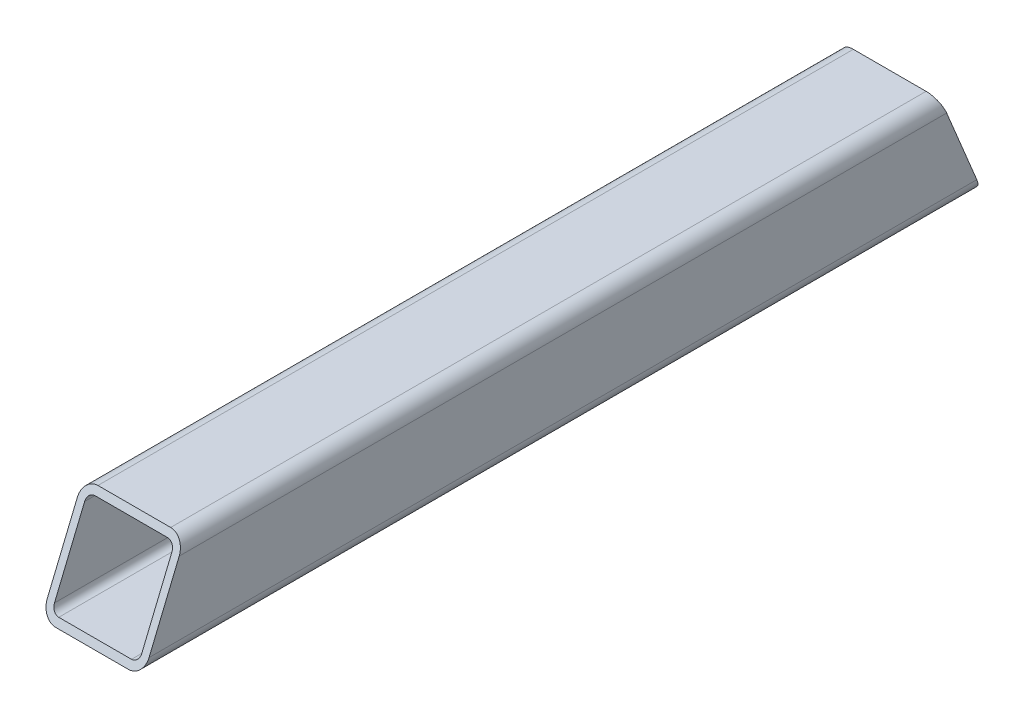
ISO-10303-21;
HEADER;
FILE_DESCRIPTION(('STEP AP214'),'2;1');
FILE_NAME('part.step','',(''),(''),'','','');
FILE_SCHEMA(('AUTOMOTIVE_DESIGN { 1 0 10303 214 1 1 1 1 }'));
ENDSEC;
DATA;
#1=APPLICATION_CONTEXT('core data for automotive mechanical design processes');
#2=APPLICATION_PROTOCOL_DEFINITION('international standard','automotive_design',2000,#1);
#3=PRODUCT_CONTEXT('',#1,'mechanical');
#4=PRODUCT('Part','Part','',(#3));
#5=PRODUCT_RELATED_PRODUCT_CATEGORY('part','',(#4));
#6=PRODUCT_DEFINITION_FORMATION('','',#4);
#7=PRODUCT_DEFINITION_CONTEXT('part definition',#1,'design');
#8=PRODUCT_DEFINITION('design','',#6,#7);
#9=PRODUCT_DEFINITION_SHAPE('','',#8);
#10=(LENGTH_UNIT() NAMED_UNIT(*) SI_UNIT(.MILLI.,.METRE.));
#11=(NAMED_UNIT(*) PLANE_ANGLE_UNIT() SI_UNIT($,.RADIAN.));
#12=(NAMED_UNIT(*) SI_UNIT($,.STERADIAN.) SOLID_ANGLE_UNIT());
#13=UNCERTAINTY_MEASURE_WITH_UNIT(LENGTH_MEASURE(1.E-05),#10,'distance_accuracy_value','');
#14=(GEOMETRIC_REPRESENTATION_CONTEXT(3) GLOBAL_UNCERTAINTY_ASSIGNED_CONTEXT((#13)) GLOBAL_UNIT_ASSIGNED_CONTEXT((#10,
#11,#12)) REPRESENTATION_CONTEXT('',''));
#15=CARTESIAN_POINT('',(0.,0.,0.));
#16=DIRECTION('',(0.,0.,1.));
#17=DIRECTION('',(1.,0.,0.));
#18=AXIS2_PLACEMENT_3D('',#15,#16,#17);
#19=CARTESIAN_POINT('',(-25.,-25.,297.));
#20=DIRECTION('',(0.,0.,-1.));
#21=DIRECTION('',(-1.,0.,0.));
#22=AXIS2_PLACEMENT_3D('',#19,#20,#21);
#23=CYLINDRICAL_SURFACE('',#22,10.);
#24=DIRECTION('',(0.,0.,-1.));
#25=VECTOR('',#24,1.);
#26=CARTESIAN_POINT('',(-25.,-35.,297.));
#27=LINE('',#26,#25);
#28=CARTESIAN_POINT('',(-25.,-35.,288.549214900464));
#29=VERTEX_POINT('',#28);
#30=CARTESIAN_POINT('',(-25.,-35.,-288.549214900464));
#31=VERTEX_POINT('',#30);
#32=EDGE_CURVE('E264',#29,#31,#27,.T.);
#33=ORIENTED_EDGE('',*,*,#32,.F.);
#34=CARTESIAN_POINT('',(-25.,-25.,284.407079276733));
#35=DIRECTION('',(0.,-0.382683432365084,-0.923879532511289));
#36=DIRECTION('',(0.,0.923879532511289,-0.382683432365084));
#37=AXIS2_PLACEMENT_3D('',#34,#35,#36);
#38=ELLIPSE('',#37,10.8239220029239,10.);
#39=CARTESIAN_POINT('',(-35.,-25.,284.407079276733));
#40=VERTEX_POINT('',#39);
#41=EDGE_CURVE('E191',#29,#40,#38,.T.);
#42=ORIENTED_EDGE('',*,*,#41,.T.);
#43=DIRECTION('',(0.,0.,-1.));
#44=VECTOR('',#43,1.);
#45=CARTESIAN_POINT('',(-35.,-25.,297.));
#46=LINE('',#45,#44);
#47=CARTESIAN_POINT('',(-35.,-25.,-284.407079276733));
#48=VERTEX_POINT('',#47);
#49=EDGE_CURVE('E250',#40,#48,#46,.T.);
#50=ORIENTED_EDGE('',*,*,#49,.T.);
#51=CARTESIAN_POINT('',(-25.,-25.,-284.407079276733));
#52=DIRECTION('',(0.,0.382683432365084,-0.923879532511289));
#53=DIRECTION('',(0.,-0.923879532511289,-0.382683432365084));
#54=AXIS2_PLACEMENT_3D('',#51,#52,#53);
#55=ELLIPSE('',#54,10.8239220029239,10.);
#56=EDGE_CURVE('E235',#31,#48,#55,.T.);
#57=ORIENTED_EDGE('',*,*,#56,.F.);
#58=EDGE_LOOP('',(#33,#42,#50,#57));
#59=FACE_BOUND('',#58,.T.);
#60=ADVANCED_FACE('F34',(#59),#23,.T.);
#61=CARTESIAN_POINT('',(-25.,-35.,297.));
#62=DIRECTION('',(0.,1.,0.));
#63=DIRECTION('',(0.,0.,1.));
#64=AXIS2_PLACEMENT_3D('',#61,#62,#63);
#65=PLANE('',#64);
#66=DIRECTION('',(0.,0.,-1.));
#67=VECTOR('',#66,1.);
#68=CARTESIAN_POINT('',(25.,-35.,297.));
#69=LINE('',#68,#67);
#70=CARTESIAN_POINT('',(25.,-35.,288.549214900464));
#71=VERTEX_POINT('',#70);
#72=CARTESIAN_POINT('',(25.,-35.,-288.549214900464));
#73=VERTEX_POINT('',#72);
#74=EDGE_CURVE('E262',#71,#73,#69,.T.);
#75=ORIENTED_EDGE('',*,*,#74,.F.);
#76=DIRECTION('',(-1.,0.,0.));
#77=VECTOR('',#76,1.);
#78=CARTESIAN_POINT('',(-25.,-35.,288.549214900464));
#79=LINE('',#78,#77);
#80=EDGE_CURVE('E188',#71,#29,#79,.T.);
#81=ORIENTED_EDGE('',*,*,#80,.T.);
#82=ORIENTED_EDGE('',*,*,#32,.T.);
#83=DIRECTION('',(-1.,0.,0.));
#84=VECTOR('',#83,1.);
#85=CARTESIAN_POINT('',(-24.9999999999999,-35.,-288.549214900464));
#86=LINE('',#85,#84);
#87=EDGE_CURVE('E232',#73,#31,#86,.T.);
#88=ORIENTED_EDGE('',*,*,#87,.F.);
#89=EDGE_LOOP('',(#75,#81,#82,#88));
#90=FACE_BOUND('',#89,.T.);
#91=ADVANCED_FACE('F270',(#90),#65,.F.);
#92=CARTESIAN_POINT('',(25.,-25.,297.));
#93=DIRECTION('',(0.,0.,-1.));
#94=DIRECTION('',(-1.,0.,0.));
#95=AXIS2_PLACEMENT_3D('',#92,#93,#94);
#96=CYLINDRICAL_SURFACE('',#95,9.99999999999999);
#97=DIRECTION('',(0.,0.,-1.));
#98=VECTOR('',#97,1.);
#99=CARTESIAN_POINT('',(35.,-25.,297.));
#100=LINE('',#99,#98);
#101=CARTESIAN_POINT('',(35.,-25.,284.407079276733));
#102=VERTEX_POINT('',#101);
#103=CARTESIAN_POINT('',(35.,-25.,-284.407079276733));
#104=VERTEX_POINT('',#103);
#105=EDGE_CURVE('E260',#102,#104,#100,.T.);
#106=ORIENTED_EDGE('',*,*,#105,.F.);
#107=CARTESIAN_POINT('',(25.,-25.,284.407079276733));
#108=DIRECTION('',(0.,-0.382683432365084,-0.923879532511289));
#109=DIRECTION('',(0.,0.923879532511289,-0.382683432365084));
#110=AXIS2_PLACEMENT_3D('',#107,#108,#109);
#111=ELLIPSE('',#110,10.8239220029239,9.99999999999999);
#112=EDGE_CURVE('E185',#102,#71,#111,.T.);
#113=ORIENTED_EDGE('',*,*,#112,.T.);
#114=ORIENTED_EDGE('',*,*,#74,.T.);
#115=CARTESIAN_POINT('',(25.,-25.,-284.407079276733));
#116=DIRECTION('',(0.,0.382683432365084,-0.923879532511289));
#117=DIRECTION('',(0.,-0.923879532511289,-0.382683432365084));
#118=AXIS2_PLACEMENT_3D('',#115,#116,#117);
#119=ELLIPSE('',#118,10.8239220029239,9.99999999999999);
#120=EDGE_CURVE('E229',#104,#73,#119,.T.);
#121=ORIENTED_EDGE('',*,*,#120,.F.);
#122=EDGE_LOOP('',(#106,#113,#114,#121));
#123=FACE_BOUND('',#122,.T.);
#124=ADVANCED_FACE('F280',(#123),#96,.T.);
#125=CARTESIAN_POINT('',(35.,25.,297.));
#126=DIRECTION('',(-1.,0.,0.));
#127=DIRECTION('',(0.,-1.,0.));
#128=AXIS2_PLACEMENT_3D('',#125,#126,#127);
#129=PLANE('',#128);
#130=DIRECTION('',(0.,0.,-1.));
#131=VECTOR('',#130,1.);
#132=CARTESIAN_POINT('',(35.,25.,297.));
#133=LINE('',#132,#131);
#134=CARTESIAN_POINT('',(35.,25.,263.696401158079));
#135=VERTEX_POINT('',#134);
#136=CARTESIAN_POINT('',(35.,25.,-263.696401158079));
#137=VERTEX_POINT('',#136);
#138=EDGE_CURVE('E258',#135,#137,#133,.T.);
#139=ORIENTED_EDGE('',*,*,#138,.F.);
#140=DIRECTION('',(0.,-0.923879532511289,0.382683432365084));
#141=VECTOR('',#140,1.);
#142=CARTESIAN_POINT('',(35.,13.2253997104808,268.57360028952));
#143=LINE('',#142,#141);
#144=EDGE_CURVE('E182',#135,#102,#143,.T.);
#145=ORIENTED_EDGE('',*,*,#144,.T.);
#146=ORIENTED_EDGE('',*,*,#105,.T.);
#147=DIRECTION('',(0.,-0.923879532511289,-0.382683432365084));
#148=VECTOR('',#147,1.);
#149=CARTESIAN_POINT('',(35.0000000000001,223.236113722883,-181.584314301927));
#150=LINE('',#149,#148);
#151=EDGE_CURVE('E226',#137,#104,#150,.T.);
#152=ORIENTED_EDGE('',*,*,#151,.F.);
#153=EDGE_LOOP('',(#139,#145,#146,#152));
#154=FACE_BOUND('',#153,.T.);
#155=ADVANCED_FACE('F283',(#154),#129,.F.);
#156=CARTESIAN_POINT('',(25.,25.,297.));
#157=DIRECTION('',(0.,0.,-1.));
#158=DIRECTION('',(-1.,0.,0.));
#159=AXIS2_PLACEMENT_3D('',#156,#157,#158);
#160=CYLINDRICAL_SURFACE('',#159,10.);
#161=DIRECTION('',(0.,0.,-1.));
#162=VECTOR('',#161,1.);
#163=CARTESIAN_POINT('',(25.,35.,297.));
#164=LINE('',#163,#162);
#165=CARTESIAN_POINT('',(25.,35.,259.554265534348));
#166=VERTEX_POINT('',#165);
#167=CARTESIAN_POINT('',(25.,35.,-259.554265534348));
#168=VERTEX_POINT('',#167);
#169=EDGE_CURVE('E256',#166,#168,#164,.T.);
#170=ORIENTED_EDGE('',*,*,#169,.F.);
#171=CARTESIAN_POINT('',(25.,25.,263.696401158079));
#172=DIRECTION('',(0.,-0.382683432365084,-0.923879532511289));
#173=DIRECTION('',(0.,0.923879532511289,-0.382683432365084));
#174=AXIS2_PLACEMENT_3D('',#171,#172,#173);
#175=ELLIPSE('',#174,10.8239220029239,10.);
#176=EDGE_CURVE('E179',#166,#135,#175,.T.);
#177=ORIENTED_EDGE('',*,*,#176,.T.);
#178=ORIENTED_EDGE('',*,*,#138,.T.);
#179=CARTESIAN_POINT('',(25.,25.,-263.696401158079));
#180=DIRECTION('',(0.,0.382683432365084,-0.923879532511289));
#181=DIRECTION('',(0.,-0.923879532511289,-0.382683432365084));
#182=AXIS2_PLACEMENT_3D('',#179,#180,#181);
#183=ELLIPSE('',#182,10.8239220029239,10.);
#184=EDGE_CURVE('E223',#168,#137,#183,.T.);
#185=ORIENTED_EDGE('',*,*,#184,.F.);
#186=EDGE_LOOP('',(#170,#177,#178,#185));
#187=FACE_BOUND('',#186,.T.);
#188=ADVANCED_FACE('F287',(#187),#160,.T.);
#189=CARTESIAN_POINT('',(-25.,35.,297.));
#190=DIRECTION('',(0.,-1.,0.));
#191=DIRECTION('',(0.,0.,-1.));
#192=AXIS2_PLACEMENT_3D('',#189,#190,#191);
#193=PLANE('',#192);
#194=DIRECTION('',(0.,0.,-1.));
#195=VECTOR('',#194,1.);
#196=CARTESIAN_POINT('',(-25.,35.,297.));
#197=LINE('',#196,#195);
#198=CARTESIAN_POINT('',(-25.,35.,259.554265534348));
#199=VERTEX_POINT('',#198);
#200=CARTESIAN_POINT('',(-25.,35.,-259.554265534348));
#201=VERTEX_POINT('',#200);
#202=EDGE_CURVE('E254',#199,#201,#197,.T.);
#203=ORIENTED_EDGE('',*,*,#202,.F.);
#204=DIRECTION('',(1.,0.,0.));
#205=VECTOR('',#204,1.);
#206=CARTESIAN_POINT('',(-25.,35.,259.554265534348));
#207=LINE('',#206,#205);
#208=EDGE_CURVE('E176',#199,#166,#207,.T.);
#209=ORIENTED_EDGE('',*,*,#208,.T.);
#210=ORIENTED_EDGE('',*,*,#169,.T.);
#211=DIRECTION('',(1.,0.,0.));
#212=VECTOR('',#211,1.);
#213=CARTESIAN_POINT('',(-24.9999999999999,35.,-259.554265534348));
#214=LINE('',#213,#212);
#215=EDGE_CURVE('E220',#201,#168,#214,.T.);
#216=ORIENTED_EDGE('',*,*,#215,.F.);
#217=EDGE_LOOP('',(#203,#209,#210,#216));
#218=FACE_BOUND('',#217,.T.);
#219=ADVANCED_FACE('F290',(#218),#193,.F.);
#220=CARTESIAN_POINT('',(-25.,25.,297.));
#221=DIRECTION('',(0.,0.,-1.));
#222=DIRECTION('',(-1.,0.,0.));
#223=AXIS2_PLACEMENT_3D('',#220,#221,#222);
#224=CYLINDRICAL_SURFACE('',#223,10.);
#225=DIRECTION('',(0.,0.,-1.));
#226=VECTOR('',#225,1.);
#227=CARTESIAN_POINT('',(-35.,25.,297.));
#228=LINE('',#227,#226);
#229=CARTESIAN_POINT('',(-35.,25.,263.696401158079));
#230=VERTEX_POINT('',#229);
#231=CARTESIAN_POINT('',(-35.,25.,-263.696401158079));
#232=VERTEX_POINT('',#231);
#233=EDGE_CURVE('E252',#230,#232,#228,.T.);
#234=ORIENTED_EDGE('',*,*,#233,.F.);
#235=CARTESIAN_POINT('',(-25.,25.,263.696401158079));
#236=DIRECTION('',(0.,-0.382683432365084,-0.923879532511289));
#237=DIRECTION('',(0.,0.923879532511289,-0.382683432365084));
#238=AXIS2_PLACEMENT_3D('',#235,#236,#237);
#239=ELLIPSE('',#238,10.8239220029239,10.);
#240=EDGE_CURVE('E48',#230,#199,#239,.T.);
#241=ORIENTED_EDGE('',*,*,#240,.T.);
#242=ORIENTED_EDGE('',*,*,#202,.T.);
#243=CARTESIAN_POINT('',(-25.,25.,-263.696401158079));
#244=DIRECTION('',(0.,0.382683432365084,-0.923879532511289));
#245=DIRECTION('',(0.,-0.923879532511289,-0.382683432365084));
#246=AXIS2_PLACEMENT_3D('',#243,#244,#245);
#247=ELLIPSE('',#246,10.8239220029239,10.);
#248=EDGE_CURVE('E217',#232,#201,#247,.T.);
#249=ORIENTED_EDGE('',*,*,#248,.F.);
#250=EDGE_LOOP('',(#234,#241,#242,#249));
#251=FACE_BOUND('',#250,.T.);
#252=ADVANCED_FACE('F295',(#251),#224,.T.);
#253=CARTESIAN_POINT('',(-35.,25.,297.));
#254=DIRECTION('',(1.,0.,0.));
#255=DIRECTION('',(0.,0.,-1.));
#256=AXIS2_PLACEMENT_3D('',#253,#254,#255);
#257=PLANE('',#256);
#258=ORIENTED_EDGE('',*,*,#49,.F.);
#259=DIRECTION('',(0.,0.923879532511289,-0.382683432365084));
#260=VECTOR('',#259,1.);
#261=CARTESIAN_POINT('',(-35.,13.2253997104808,268.57360028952));
#262=LINE('',#261,#260);
#263=EDGE_CURVE('E168',#40,#230,#262,.T.);
#264=ORIENTED_EDGE('',*,*,#263,.T.);
#265=ORIENTED_EDGE('',*,*,#233,.T.);
#266=DIRECTION('',(0.,0.923879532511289,0.382683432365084));
#267=VECTOR('',#266,1.);
#268=CARTESIAN_POINT('',(-35.,223.236113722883,-181.584314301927));
#269=LINE('',#268,#267);
#270=EDGE_CURVE('E214',#48,#232,#269,.T.);
#271=ORIENTED_EDGE('',*,*,#270,.F.);
#272=EDGE_LOOP('',(#258,#264,#265,#271));
#273=FACE_BOUND('',#272,.T.);
#274=ADVANCED_FACE('F297',(#273),#257,.F.);
#275=CARTESIAN_POINT('',(-25.,25.,297.));
#276=DIRECTION('',(0.,0.,-1.));
#277=DIRECTION('',(-1.,0.,0.));
#278=AXIS2_PLACEMENT_3D('',#275,#276,#277);
#279=CYLINDRICAL_SURFACE('',#278,5.);
#280=CARTESIAN_POINT('',(-25.,25.,263.696401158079));
#281=DIRECTION('',(0.,-0.382683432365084,-0.923879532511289));
#282=DIRECTION('',(0.,0.923879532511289,-0.382683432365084));
#283=AXIS2_PLACEMENT_3D('',#280,#281,#282);
#284=ELLIPSE('',#283,5.41196100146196,5.);
#285=CARTESIAN_POINT('',(-30.,25.,263.696401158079));
#286=VERTEX_POINT('',#285);
#287=CARTESIAN_POINT('',(-25.,30.,261.625333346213));
#288=VERTEX_POINT('',#287);
#289=EDGE_CURVE('E56',#286,#288,#284,.T.);
#290=ORIENTED_EDGE('',*,*,#289,.F.);
#291=DIRECTION('',(0.,0.,-1.));
#292=VECTOR('',#291,1.);
#293=CARTESIAN_POINT('',(-30.,25.,297.));
#294=LINE('',#293,#292);
#295=CARTESIAN_POINT('',(-30.,25.,-263.696401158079));
#296=VERTEX_POINT('',#295);
#297=EDGE_CURVE('E248',#286,#296,#294,.T.);
#298=ORIENTED_EDGE('',*,*,#297,.T.);
#299=CARTESIAN_POINT('',(-25.,25.,-263.696401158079));
#300=DIRECTION('',(0.,0.382683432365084,-0.923879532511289));
#301=DIRECTION('',(0.,-0.923879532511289,-0.382683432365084));
#302=AXIS2_PLACEMENT_3D('',#299,#300,#301);
#303=ELLIPSE('',#302,5.41196100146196,5.);
#304=CARTESIAN_POINT('',(-25.,30.,-261.625333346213));
#305=VERTEX_POINT('',#304);
#306=EDGE_CURVE('E211',#296,#305,#303,.T.);
#307=ORIENTED_EDGE('',*,*,#306,.T.);
#308=DIRECTION('',(0.,0.,-1.));
#309=VECTOR('',#308,1.);
#310=CARTESIAN_POINT('',(-25.,30.,297.));
#311=LINE('',#310,#309);
#312=EDGE_CURVE('E154',#288,#305,#311,.T.);
#313=ORIENTED_EDGE('',*,*,#312,.F.);
#314=EDGE_LOOP('',(#290,#298,#307,#313));
#315=FACE_BOUND('',#314,.T.);
#316=ADVANCED_FACE('F299',(#315),#279,.F.);
#317=CARTESIAN_POINT('',(-30.,25.,297.));
#318=DIRECTION('',(1.,0.,0.));
#319=DIRECTION('',(0.,1.,0.));
#320=AXIS2_PLACEMENT_3D('',#317,#318,#319);
#321=PLANE('',#320);
#322=DIRECTION('',(0.,0.923879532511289,-0.382683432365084));
#323=VECTOR('',#322,1.);
#324=CARTESIAN_POINT('',(-30.,13.2253997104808,268.57360028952));
#325=LINE('',#324,#323);
#326=CARTESIAN_POINT('',(-30.,-25.,284.407079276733));
#327=VERTEX_POINT('',#326);
#328=EDGE_CURVE('E167',#327,#286,#325,.T.);
#329=ORIENTED_EDGE('',*,*,#328,.F.);
#330=DIRECTION('',(0.,0.,-1.));
#331=VECTOR('',#330,1.);
#332=CARTESIAN_POINT('',(-30.,-25.,297.));
#333=LINE('',#332,#331);
#334=CARTESIAN_POINT('',(-30.,-25.,-284.407079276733));
#335=VERTEX_POINT('',#334);
#336=EDGE_CURVE('E246',#327,#335,#333,.T.);
#337=ORIENTED_EDGE('',*,*,#336,.T.);
#338=DIRECTION('',(0.,0.923879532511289,0.382683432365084));
#339=VECTOR('',#338,1.);
#340=CARTESIAN_POINT('',(-30.,223.236113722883,-181.584314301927));
#341=LINE('',#340,#339);
#342=EDGE_CURVE('E208',#335,#296,#341,.T.);
#343=ORIENTED_EDGE('',*,*,#342,.T.);
#344=ORIENTED_EDGE('',*,*,#297,.F.);
#345=EDGE_LOOP('',(#329,#337,#343,#344));
#346=FACE_BOUND('',#345,.T.);
#347=ADVANCED_FACE('F305',(#346),#321,.T.);
#348=CARTESIAN_POINT('',(-25.,-25.,297.));
#349=DIRECTION('',(0.,0.,-1.));
#350=DIRECTION('',(-1.,0.,0.));
#351=AXIS2_PLACEMENT_3D('',#348,#349,#350);
#352=CYLINDRICAL_SURFACE('',#351,5.);
#353=CARTESIAN_POINT('',(-25.,-25.,284.407079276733));
#354=DIRECTION('',(0.,-0.382683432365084,-0.923879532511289));
#355=DIRECTION('',(0.,0.923879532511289,-0.382683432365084));
#356=AXIS2_PLACEMENT_3D('',#353,#354,#355);
#357=ELLIPSE('',#356,5.41196100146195,5.);
#358=CARTESIAN_POINT('',(-25.,-30.,286.478147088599));
#359=VERTEX_POINT('',#358);
#360=EDGE_CURVE('E171',#359,#327,#357,.T.);
#361=ORIENTED_EDGE('',*,*,#360,.F.);
#362=DIRECTION('',(0.,0.,-1.));
#363=VECTOR('',#362,1.);
#364=CARTESIAN_POINT('',(-25.,-30.,297.));
#365=LINE('',#364,#363);
#366=CARTESIAN_POINT('',(-25.,-30.,-286.478147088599));
#367=VERTEX_POINT('',#366);
#368=EDGE_CURVE('E244',#359,#367,#365,.T.);
#369=ORIENTED_EDGE('',*,*,#368,.T.);
#370=CARTESIAN_POINT('',(-25.,-25.,-284.407079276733));
#371=DIRECTION('',(0.,0.382683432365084,-0.923879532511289));
#372=DIRECTION('',(0.,-0.923879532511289,-0.382683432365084));
#373=AXIS2_PLACEMENT_3D('',#370,#371,#372);
#374=ELLIPSE('',#373,5.41196100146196,5.);
#375=EDGE_CURVE('E205',#367,#335,#374,.T.);
#376=ORIENTED_EDGE('',*,*,#375,.T.);
#377=ORIENTED_EDGE('',*,*,#336,.F.);
#378=EDGE_LOOP('',(#361,#369,#376,#377));
#379=FACE_BOUND('',#378,.T.);
#380=ADVANCED_FACE('F349',(#379),#352,.F.);
#381=CARTESIAN_POINT('',(-25.,-30.,297.));
#382=DIRECTION('',(0.,1.,0.));
#383=DIRECTION('',(-1.,0.,0.));
#384=AXIS2_PLACEMENT_3D('',#381,#382,#383);
#385=PLANE('',#384);
#386=DIRECTION('',(-1.,0.,0.));
#387=VECTOR('',#386,1.);
#388=CARTESIAN_POINT('',(-25.,-30.,286.478147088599));
#389=LINE('',#388,#387);
#390=CARTESIAN_POINT('',(25.,-30.,286.478147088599));
#391=VERTEX_POINT('',#390);
#392=EDGE_CURVE('E459',#391,#359,#389,.T.);
#393=ORIENTED_EDGE('',*,*,#392,.F.);
#394=DIRECTION('',(0.,0.,-1.));
#395=VECTOR('',#394,1.);
#396=CARTESIAN_POINT('',(25.,-30.,297.));
#397=LINE('',#396,#395);
#398=CARTESIAN_POINT('',(25.,-30.,-286.478147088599));
#399=VERTEX_POINT('',#398);
#400=EDGE_CURVE('E242',#391,#399,#397,.T.);
#401=ORIENTED_EDGE('',*,*,#400,.T.);
#402=DIRECTION('',(-1.,0.,0.));
#403=VECTOR('',#402,1.);
#404=CARTESIAN_POINT('',(-25.,-30.,-286.478147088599));
#405=LINE('',#404,#403);
#406=EDGE_CURVE('E202',#399,#367,#405,.T.);
#407=ORIENTED_EDGE('',*,*,#406,.T.);
#408=ORIENTED_EDGE('',*,*,#368,.F.);
#409=EDGE_LOOP('',(#393,#401,#407,#408));
#410=FACE_BOUND('',#409,.T.);
#411=ADVANCED_FACE('F359',(#410),#385,.T.);
#412=CARTESIAN_POINT('',(25.,-25.,297.));
#413=DIRECTION('',(0.,0.,-1.));
#414=DIRECTION('',(-1.,0.,0.));
#415=AXIS2_PLACEMENT_3D('',#412,#413,#414);
#416=CYLINDRICAL_SURFACE('',#415,5.);
#417=CARTESIAN_POINT('',(25.,-25.,284.407079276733));
#418=DIRECTION('',(0.,-0.382683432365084,-0.923879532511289));
#419=DIRECTION('',(0.,0.923879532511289,-0.382683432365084));
#420=AXIS2_PLACEMENT_3D('',#417,#418,#419);
#421=ELLIPSE('',#420,5.41196100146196,5.);
#422=CARTESIAN_POINT('',(30.,-25.,284.407079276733));
#423=VERTEX_POINT('',#422);
#424=EDGE_CURVE('E460',#423,#391,#421,.T.);
#425=ORIENTED_EDGE('',*,*,#424,.F.);
#426=DIRECTION('',(0.,0.,-1.));
#427=VECTOR('',#426,1.);
#428=CARTESIAN_POINT('',(30.,-25.,297.));
#429=LINE('',#428,#427);
#430=CARTESIAN_POINT('',(30.,-25.,-284.407079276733));
#431=VERTEX_POINT('',#430);
#432=EDGE_CURVE('E240',#423,#431,#429,.T.);
#433=ORIENTED_EDGE('',*,*,#432,.T.);
#434=CARTESIAN_POINT('',(25.,-25.,-284.407079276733));
#435=DIRECTION('',(0.,0.382683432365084,-0.923879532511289));
#436=DIRECTION('',(0.,-0.923879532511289,-0.382683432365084));
#437=AXIS2_PLACEMENT_3D('',#434,#435,#436);
#438=ELLIPSE('',#437,5.41196100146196,5.);
#439=EDGE_CURVE('E199',#431,#399,#438,.T.);
#440=ORIENTED_EDGE('',*,*,#439,.T.);
#441=ORIENTED_EDGE('',*,*,#400,.F.);
#442=EDGE_LOOP('',(#425,#433,#440,#441));
#443=FACE_BOUND('',#442,.T.);
#444=ADVANCED_FACE('F369',(#443),#416,.F.);
#445=CARTESIAN_POINT('',(30.,25.,297.));
#446=DIRECTION('',(-1.,0.,0.));
#447=DIRECTION('',(0.,0.,1.));
#448=AXIS2_PLACEMENT_3D('',#445,#446,#447);
#449=PLANE('',#448);
#450=DIRECTION('',(0.,-0.923879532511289,0.382683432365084));
#451=VECTOR('',#450,1.);
#452=CARTESIAN_POINT('',(30.,13.2253997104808,268.57360028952));
#453=LINE('',#452,#451);
#454=CARTESIAN_POINT('',(30.,25.,263.696401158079));
#455=VERTEX_POINT('',#454);
#456=EDGE_CURVE('E162',#455,#423,#453,.T.);
#457=ORIENTED_EDGE('',*,*,#456,.F.);
#458=DIRECTION('',(0.,0.,-1.));
#459=VECTOR('',#458,1.);
#460=CARTESIAN_POINT('',(30.,25.,297.));
#461=LINE('',#460,#459);
#462=CARTESIAN_POINT('',(30.,25.,-263.696401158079));
#463=VERTEX_POINT('',#462);
#464=EDGE_CURVE('E153',#455,#463,#461,.T.);
#465=ORIENTED_EDGE('',*,*,#464,.T.);
#466=DIRECTION('',(0.,-0.923879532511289,-0.382683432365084));
#467=VECTOR('',#466,1.);
#468=CARTESIAN_POINT('',(30.,223.236113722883,-181.584314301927));
#469=LINE('',#468,#467);
#470=EDGE_CURVE('E196',#463,#431,#469,.T.);
#471=ORIENTED_EDGE('',*,*,#470,.T.);
#472=ORIENTED_EDGE('',*,*,#432,.F.);
#473=EDGE_LOOP('',(#457,#465,#471,#472));
#474=FACE_BOUND('',#473,.T.);
#475=ADVANCED_FACE('F379',(#474),#449,.T.);
#476=CARTESIAN_POINT('',(25.,25.,297.));
#477=DIRECTION('',(0.,0.,-1.));
#478=DIRECTION('',(-1.,0.,0.));
#479=AXIS2_PLACEMENT_3D('',#476,#477,#478);
#480=CYLINDRICAL_SURFACE('',#479,5.);
#481=CARTESIAN_POINT('',(25.,25.,263.696401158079));
#482=DIRECTION('',(0.,-0.382683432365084,-0.923879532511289));
#483=DIRECTION('',(0.,0.923879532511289,-0.382683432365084));
#484=AXIS2_PLACEMENT_3D('',#481,#482,#483);
#485=ELLIPSE('',#484,5.41196100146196,5.);
#486=CARTESIAN_POINT('',(25.,30.,261.625333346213));
#487=VERTEX_POINT('',#486);
#488=EDGE_CURVE('E158',#487,#455,#485,.T.);
#489=ORIENTED_EDGE('',*,*,#488,.F.);
#490=DIRECTION('',(0.,0.,-1.));
#491=VECTOR('',#490,1.);
#492=CARTESIAN_POINT('',(25.,30.,297.));
#493=LINE('',#492,#491);
#494=CARTESIAN_POINT('',(25.,30.,-261.625333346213));
#495=VERTEX_POINT('',#494);
#496=EDGE_CURVE('E146',#487,#495,#493,.T.);
#497=ORIENTED_EDGE('',*,*,#496,.T.);
#498=CARTESIAN_POINT('',(25.,25.,-263.696401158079));
#499=DIRECTION('',(0.,0.382683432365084,-0.923879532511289));
#500=DIRECTION('',(0.,-0.923879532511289,-0.382683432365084));
#501=AXIS2_PLACEMENT_3D('',#498,#499,#500);
#502=ELLIPSE('',#501,5.41196100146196,5.);
#503=EDGE_CURVE('E194',#495,#463,#502,.T.);
#504=ORIENTED_EDGE('',*,*,#503,.T.);
#505=ORIENTED_EDGE('',*,*,#464,.F.);
#506=EDGE_LOOP('',(#489,#497,#504,#505));
#507=FACE_BOUND('',#506,.T.);
#508=ADVANCED_FACE('F159',(#507),#480,.F.);
#509=CARTESIAN_POINT('',(-25.,30.,297.));
#510=DIRECTION('',(0.,-1.,0.));
#511=DIRECTION('',(0.,0.,-1.));
#512=AXIS2_PLACEMENT_3D('',#509,#510,#511);
#513=PLANE('',#512);
#514=DIRECTION('',(1.,0.,0.));
#515=VECTOR('',#514,1.);
#516=CARTESIAN_POINT('',(-25.,30.,261.625333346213));
#517=LINE('',#516,#515);
#518=EDGE_CURVE('E11',#288,#487,#517,.T.);
#519=ORIENTED_EDGE('',*,*,#518,.F.);
#520=ORIENTED_EDGE('',*,*,#312,.T.);
#521=DIRECTION('',(1.,0.,0.));
#522=VECTOR('',#521,1.);
#523=CARTESIAN_POINT('',(-24.9999999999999,30.,-261.625333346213));
#524=LINE('',#523,#522);
#525=EDGE_CURVE('E41',#305,#495,#524,.T.);
#526=ORIENTED_EDGE('',*,*,#525,.T.);
#527=ORIENTED_EDGE('',*,*,#496,.F.);
#528=EDGE_LOOP('',(#519,#520,#526,#527));
#529=FACE_BOUND('',#528,.T.);
#530=ADVANCED_FACE('F148',(#529),#513,.T.);
#531=CARTESIAN_POINT('',(862.740825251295,158.199539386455,-208.523345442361));
#532=DIRECTION('',(0.,0.382683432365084,-0.923879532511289));
#533=DIRECTION('',(0.,0.923879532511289,0.382683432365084));
#534=AXIS2_PLACEMENT_3D('',#531,#532,#533);
#535=PLANE('',#534);
#536=ORIENTED_EDGE('',*,*,#306,.F.);
#537=ORIENTED_EDGE('',*,*,#342,.F.);
#538=ORIENTED_EDGE('',*,*,#375,.F.);
#539=ORIENTED_EDGE('',*,*,#406,.F.);
#540=ORIENTED_EDGE('',*,*,#439,.F.);
#541=ORIENTED_EDGE('',*,*,#470,.F.);
#542=ORIENTED_EDGE('',*,*,#503,.F.);
#543=ORIENTED_EDGE('',*,*,#525,.F.);
#544=EDGE_LOOP('',(#536,#537,#538,#539,#540,#541,#542,#543));
#545=FACE_BOUND('',#544,.T.);
#546=ORIENTED_EDGE('',*,*,#87,.T.);
#547=ORIENTED_EDGE('',*,*,#56,.T.);
#548=ORIENTED_EDGE('',*,*,#270,.T.);
#549=ORIENTED_EDGE('',*,*,#248,.T.);
#550=ORIENTED_EDGE('',*,*,#215,.T.);
#551=ORIENTED_EDGE('',*,*,#184,.T.);
#552=ORIENTED_EDGE('',*,*,#151,.T.);
#553=ORIENTED_EDGE('',*,*,#120,.T.);
#554=EDGE_LOOP('',(#546,#547,#548,#549,#550,#551,#552,#553));
#555=FACE_BOUND('',#554,.T.);
#556=ADVANCED_FACE('F275',(#545,#555),#535,.T.);
#557=CARTESIAN_POINT('',(852.323088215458,158.199539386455,208.523345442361));
#558=DIRECTION('',(0.,-0.382683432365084,-0.923879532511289));
#559=DIRECTION('',(0.,0.923879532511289,-0.382683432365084));
#560=AXIS2_PLACEMENT_3D('',#557,#558,#559);
#561=PLANE('',#560);
#562=ORIENTED_EDGE('',*,*,#328,.T.);
#563=ORIENTED_EDGE('',*,*,#289,.T.);
#564=ORIENTED_EDGE('',*,*,#518,.T.);
#565=ORIENTED_EDGE('',*,*,#488,.T.);
#566=ORIENTED_EDGE('',*,*,#456,.T.);
#567=ORIENTED_EDGE('',*,*,#424,.T.);
#568=ORIENTED_EDGE('',*,*,#392,.T.);
#569=ORIENTED_EDGE('',*,*,#360,.T.);
#570=EDGE_LOOP('',(#562,#563,#564,#565,#566,#567,#568,#569));
#571=FACE_BOUND('',#570,.T.);
#572=ORIENTED_EDGE('',*,*,#41,.F.);
#573=ORIENTED_EDGE('',*,*,#80,.F.);
#574=ORIENTED_EDGE('',*,*,#112,.F.);
#575=ORIENTED_EDGE('',*,*,#144,.F.);
#576=ORIENTED_EDGE('',*,*,#176,.F.);
#577=ORIENTED_EDGE('',*,*,#208,.F.);
#578=ORIENTED_EDGE('',*,*,#240,.F.);
#579=ORIENTED_EDGE('',*,*,#263,.F.);
#580=EDGE_LOOP('',(#572,#573,#574,#575,#576,#577,#578,#579));
#581=FACE_BOUND('',#580,.T.);
#582=ADVANCED_FACE('F165',(#571,#581),#561,.F.);
#583=CLOSED_SHELL('',(#60,#91,#124,#155,#188,#219,#252,#274,#316,#347,#380,#411,#444,#475,#508,
#530,#556,#582));
#584=MANIFOLD_SOLID_BREP('B2',#583);
#585=ADVANCED_BREP_SHAPE_REPRESENTATION('',(#18,#584),#14);
#586=SHAPE_DEFINITION_REPRESENTATION(#9,#585);
ENDSEC;
END-ISO-10303-21;
